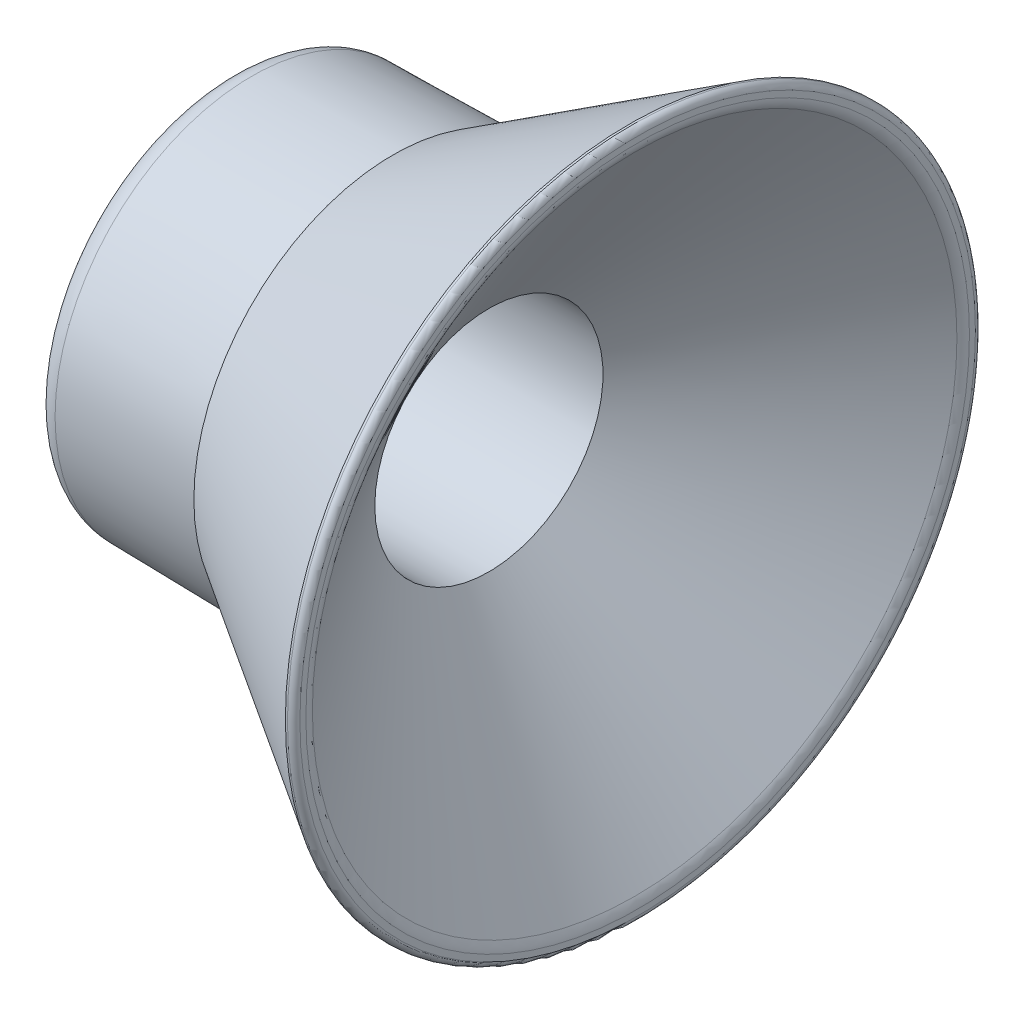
ISO-10303-21;
HEADER;
FILE_DESCRIPTION(('STEP AP214'),'2;1');
FILE_NAME('part.step','',(''),(''),'','','');
FILE_SCHEMA(('AUTOMOTIVE_DESIGN { 1 0 10303 214 1 1 1 1 }'));
ENDSEC;
DATA;
#1=APPLICATION_CONTEXT('core data for automotive mechanical design processes');
#2=APPLICATION_PROTOCOL_DEFINITION('international standard','automotive_design',2000,#1);
#3=PRODUCT_CONTEXT('',#1,'mechanical');
#4=PRODUCT('Part','Part','',(#3));
#5=PRODUCT_RELATED_PRODUCT_CATEGORY('part','',(#4));
#6=PRODUCT_DEFINITION_FORMATION('','',#4);
#7=PRODUCT_DEFINITION_CONTEXT('part definition',#1,'design');
#8=PRODUCT_DEFINITION('design','',#6,#7);
#9=PRODUCT_DEFINITION_SHAPE('','',#8);
#10=(LENGTH_UNIT() NAMED_UNIT(*) SI_UNIT(.MILLI.,.METRE.));
#11=(NAMED_UNIT(*) PLANE_ANGLE_UNIT() SI_UNIT($,.RADIAN.));
#12=(NAMED_UNIT(*) SI_UNIT($,.STERADIAN.) SOLID_ANGLE_UNIT());
#13=UNCERTAINTY_MEASURE_WITH_UNIT(LENGTH_MEASURE(1.E-05),#10,'distance_accuracy_value','');
#14=(GEOMETRIC_REPRESENTATION_CONTEXT(3) GLOBAL_UNCERTAINTY_ASSIGNED_CONTEXT((#13)) GLOBAL_UNIT_ASSIGNED_CONTEXT((#10,
#11,#12)) REPRESENTATION_CONTEXT('',''));
#15=CARTESIAN_POINT('',(0.,0.,0.));
#16=DIRECTION('',(0.,0.,1.));
#17=DIRECTION('',(1.,0.,0.));
#18=AXIS2_PLACEMENT_3D('',#15,#16,#17);
#19=CARTESIAN_POINT('',(0.,0.,0.));
#20=DIRECTION('',(1.,0.,0.));
#21=DIRECTION('',(0.,0.,-1.));
#22=AXIS2_PLACEMENT_3D('',#19,#20,#21);
#23=PLANE('',#22);
#24=CARTESIAN_POINT('',(0.,0.,0.));
#25=DIRECTION('',(-1.,0.,0.));
#26=DIRECTION('',(0.,0.,1.));
#27=AXIS2_PLACEMENT_3D('',#24,#25,#26);
#28=CIRCLE('',#27,5.08);
#29=CARTESIAN_POINT('',(0.,0.,5.08));
#30=VERTEX_POINT('',#29);
#31=EDGE_CURVE('E75',#30,#30,#28,.T.);
#32=ORIENTED_EDGE('',*,*,#31,.F.);
#33=EDGE_LOOP('',(#32));
#34=FACE_BOUND('',#33,.T.);
#35=CARTESIAN_POINT('',(0.,0.,0.));
#36=DIRECTION('',(1.,0.,0.));
#37=DIRECTION('',(0.,0.,-1.));
#38=AXIS2_PLACEMENT_3D('',#35,#36,#37);
#39=CIRCLE('',#38,10.6442741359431);
#40=CARTESIAN_POINT('',(0.,0.,-10.6442741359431));
#41=VERTEX_POINT('',#40);
#42=EDGE_CURVE('E39',#41,#41,#39,.F.);
#43=ORIENTED_EDGE('',*,*,#42,.T.);
#44=EDGE_LOOP('',(#43));
#45=FACE_BOUND('',#44,.T.);
#46=ADVANCED_FACE('F14',(#34,#45),#23,.F.);
#47=CARTESIAN_POINT('',(24.9936,21.0566,0.));
#48=DIRECTION('',(-1.,0.,0.));
#49=DIRECTION('',(0.,0.,1.));
#50=AXIS2_PLACEMENT_3D('',#47,#48,#49);
#51=PLANE('',#50);
#52=CARTESIAN_POINT('',(24.9936,0.,0.));
#53=DIRECTION('',(-1.,0.,0.));
#54=DIRECTION('',(0.,0.,1.));
#55=AXIS2_PLACEMENT_3D('',#52,#53,#54);
#56=CIRCLE('',#55,20.3101435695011);
#57=CARTESIAN_POINT('',(24.9936,0.,20.3101435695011));
#58=VERTEX_POINT('',#57);
#59=EDGE_CURVE('E71',#58,#58,#56,.T.);
#60=ORIENTED_EDGE('',*,*,#59,.T.);
#61=EDGE_LOOP('',(#60));
#62=FACE_BOUND('',#61,.T.);
#63=CARTESIAN_POINT('',(24.9936,0.,0.));
#64=DIRECTION('',(-1.,0.,0.));
#65=DIRECTION('',(0.,0.,1.));
#66=AXIS2_PLACEMENT_3D('',#63,#64,#65);
#67=CIRCLE('',#66,20.6756);
#68=CARTESIAN_POINT('',(24.9936,0.,20.6756));
#69=VERTEX_POINT('',#68);
#70=EDGE_CURVE('E9',#69,#69,#67,.F.);
#71=ORIENTED_EDGE('',*,*,#70,.T.);
#72=EDGE_LOOP('',(#71));
#73=FACE_BOUND('',#72,.T.);
#74=ADVANCED_FACE('F88',(#62,#73),#51,.F.);
#75=CARTESIAN_POINT('',(10.0198875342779,0.,0.));
#76=DIRECTION('',(1.,0.,0.));
#77=DIRECTION('',(0.,0.,-1.));
#78=AXIS2_PLACEMENT_3D('',#75,#76,#77);
#79=CONICAL_SURFACE('',#78,12.192,0.0174532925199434);
#80=CARTESIAN_POINT('',(1.37261898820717,0.,0.));
#81=DIRECTION('',(-1.,0.,0.));
#82=DIRECTION('',(0.,0.,1.));
#83=AXIS2_PLACEMENT_3D('',#80,#81,#82);
#84=CIRCLE('',#83,12.0410613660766);
#85=CARTESIAN_POINT('',(1.37261898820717,0.,12.0410613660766));
#86=VERTEX_POINT('',#85);
#87=EDGE_CURVE('E32',#86,#86,#84,.F.);
#88=ORIENTED_EDGE('',*,*,#87,.T.);
#89=EDGE_LOOP('',(#88));
#90=FACE_BOUND('',#89,.T.);
#91=CARTESIAN_POINT('',(10.0198875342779,0.,0.));
#92=DIRECTION('',(-1.,0.,0.));
#93=DIRECTION('',(0.,0.,1.));
#94=AXIS2_PLACEMENT_3D('',#91,#92,#93);
#95=CIRCLE('',#94,12.192);
#96=CARTESIAN_POINT('',(10.0198875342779,0.,12.192));
#97=VERTEX_POINT('',#96);
#98=EDGE_CURVE('E45',#97,#97,#95,.T.);
#99=ORIENTED_EDGE('',*,*,#98,.T.);
#100=EDGE_LOOP('',(#99));
#101=FACE_BOUND('',#100,.T.);
#102=ADVANCED_FACE('F108',(#90,#101),#79,.T.);
#103=CARTESIAN_POINT('',(24.4856,0.,0.));
#104=DIRECTION('',(1.,0.,0.));
#105=DIRECTION('',(0.,0.,-1.));
#106=AXIS2_PLACEMENT_3D('',#103,#104,#105);
#107=CONICAL_SURFACE('',#106,21.0566,0.549778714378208);
#108=ORIENTED_EDGE('',*,*,#98,.F.);
#109=EDGE_LOOP('',(#108));
#110=FACE_BOUND('',#109,.T.);
#111=CARTESIAN_POINT('',(24.4856,0.,0.));
#112=DIRECTION('',(-1.,0.,0.));
#113=DIRECTION('',(0.,0.,1.));
#114=AXIS2_PLACEMENT_3D('',#111,#112,#113);
#115=CIRCLE('',#114,21.0566);
#116=CARTESIAN_POINT('',(24.4856,0.,21.0566));
#117=VERTEX_POINT('',#116);
#118=EDGE_CURVE('E49',#117,#117,#115,.T.);
#119=ORIENTED_EDGE('',*,*,#118,.T.);
#120=EDGE_LOOP('',(#119));
#121=FACE_BOUND('',#120,.T.);
#122=ADVANCED_FACE('F104',(#110,#121),#107,.T.);
#123=CARTESIAN_POINT('',(0.,0.,0.));
#124=DIRECTION('',(-1.,0.,0.));
#125=DIRECTION('',(0.,0.,1.));
#126=AXIS2_PLACEMENT_3D('',#123,#124,#125);
#127=CYLINDRICAL_SURFACE('',#126,21.0566);
#128=CARTESIAN_POINT('',(24.6126,0.,0.));
#129=DIRECTION('',(-1.,0.,0.));
#130=DIRECTION('',(0.,0.,1.));
#131=AXIS2_PLACEMENT_3D('',#128,#129,#130);
#132=CIRCLE('',#131,21.0566);
#133=CARTESIAN_POINT('',(24.6126,0.,21.0566));
#134=VERTEX_POINT('',#133);
#135=EDGE_CURVE('E22',#134,#134,#132,.T.);
#136=ORIENTED_EDGE('',*,*,#135,.T.);
#137=EDGE_LOOP('',(#136));
#138=FACE_BOUND('',#137,.T.);
#139=ORIENTED_EDGE('',*,*,#118,.F.);
#140=EDGE_LOOP('',(#139));
#141=FACE_BOUND('',#140,.T.);
#142=ADVANCED_FACE('F94',(#138,#141),#127,.T.);
#143=CARTESIAN_POINT('',(1.397,0.,0.));
#144=DIRECTION('',(1.,0.,0.));
#145=DIRECTION('',(0.,0.,-1.));
#146=AXIS2_PLACEMENT_3D('',#143,#144,#145);
#147=TOROIDAL_SURFACE('',#146,10.6442741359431,1.397);
#148=ORIENTED_EDGE('',*,*,#87,.F.);
#149=EDGE_LOOP('',(#148));
#150=FACE_BOUND('',#149,.T.);
#151=ORIENTED_EDGE('',*,*,#42,.F.);
#152=EDGE_LOOP('',(#151));
#153=FACE_BOUND('',#152,.T.);
#154=ADVANCED_FACE('F92',(#150,#153),#147,.T.);
#155=CARTESIAN_POINT('',(24.6126,0.,0.));
#156=DIRECTION('',(-1.,0.,0.));
#157=DIRECTION('',(0.,0.,1.));
#158=AXIS2_PLACEMENT_3D('',#155,#156,#157);
#159=TOROIDAL_SURFACE('',#158,20.6756,0.381);
#160=ORIENTED_EDGE('',*,*,#70,.F.);
#161=EDGE_LOOP('',(#160));
#162=FACE_BOUND('',#161,.T.);
#163=ORIENTED_EDGE('',*,*,#135,.F.);
#164=EDGE_LOOP('',(#163));
#165=FACE_BOUND('',#164,.T.);
#166=ADVANCED_FACE('F16',(#162,#165),#159,.T.);
#167=CARTESIAN_POINT('',(23.9776,0.,0.));
#168=DIRECTION('',(-1.,0.,0.));
#169=DIRECTION('',(0.,0.,1.));
#170=AXIS2_PLACEMENT_3D('',#167,#168,#169);
#171=TOROIDAL_SURFACE('',#170,20.3101435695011,1.016);
#172=CARTESIAN_POINT('',(24.8098584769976,0.,0.));
#173=DIRECTION('',(1.,0.,0.));
#174=DIRECTION('',(0.,0.,-1.));
#175=AXIS2_PLACEMENT_3D('',#172,#173,#174);
#176=CIRCLE('',#175,19.7273899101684);
#177=CARTESIAN_POINT('',(24.8098584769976,0.,-19.7273899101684));
#178=VERTEX_POINT('',#177);
#179=EDGE_CURVE('E52',#178,#178,#176,.T.);
#180=ORIENTED_EDGE('',*,*,#179,.F.);
#181=EDGE_LOOP('',(#180));
#182=FACE_BOUND('',#181,.T.);
#183=ORIENTED_EDGE('',*,*,#59,.F.);
#184=EDGE_LOOP('',(#183));
#185=FACE_BOUND('',#184,.T.);
#186=ADVANCED_FACE('F102',(#182,#185),#171,.T.);
#187=CARTESIAN_POINT('',(24.9936,0.,0.));
#188=DIRECTION('',(1.,0.,0.));
#189=DIRECTION('',(0.,0.,-1.));
#190=AXIS2_PLACEMENT_3D('',#187,#188,#189);
#191=CONICAL_SURFACE('',#190,19.9898,0.959931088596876);
#192=ORIENTED_EDGE('',*,*,#179,.T.);
#193=EDGE_LOOP('',(#192));
#194=FACE_BOUND('',#193,.T.);
#195=CARTESIAN_POINT('',(15.8875410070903,0.,0.));
#196=DIRECTION('',(-1.,0.,0.));
#197=DIRECTION('',(0.,0.,1.));
#198=AXIS2_PLACEMENT_3D('',#195,#196,#197);
#199=CIRCLE('',#198,6.985);
#200=CARTESIAN_POINT('',(15.8875410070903,0.,6.985));
#201=VERTEX_POINT('',#200);
#202=EDGE_CURVE('E55',#201,#201,#199,.T.);
#203=ORIENTED_EDGE('',*,*,#202,.T.);
#204=EDGE_LOOP('',(#203));
#205=FACE_BOUND('',#204,.T.);
#206=ADVANCED_FACE('F120',(#194,#205),#191,.F.);
#207=CARTESIAN_POINT('',(0.,0.,0.));
#208=DIRECTION('',(-1.,0.,0.));
#209=DIRECTION('',(0.,0.,1.));
#210=AXIS2_PLACEMENT_3D('',#207,#208,#209);
#211=CYLINDRICAL_SURFACE('',#210,6.985);
#212=CARTESIAN_POINT('',(5.7912,0.,0.));
#213=DIRECTION('',(-1.,0.,0.));
#214=DIRECTION('',(0.,0.,1.));
#215=AXIS2_PLACEMENT_3D('',#212,#213,#214);
#216=CIRCLE('',#215,6.985);
#217=CARTESIAN_POINT('',(5.7912,0.,6.985));
#218=VERTEX_POINT('',#217);
#219=EDGE_CURVE('E59',#218,#218,#216,.T.);
#220=ORIENTED_EDGE('',*,*,#219,.T.);
#221=EDGE_LOOP('',(#220));
#222=FACE_BOUND('',#221,.T.);
#223=ORIENTED_EDGE('',*,*,#202,.F.);
#224=EDGE_LOOP('',(#223));
#225=FACE_BOUND('',#224,.T.);
#226=ADVANCED_FACE('F124',(#222,#225),#211,.F.);
#227=CARTESIAN_POINT('',(5.7912,3.683,0.));
#228=DIRECTION('',(1.,0.,0.));
#229=DIRECTION('',(0.,0.,-1.));
#230=AXIS2_PLACEMENT_3D('',#227,#228,#229);
#231=PLANE('',#230);
#232=CARTESIAN_POINT('',(5.7912,0.,0.));
#233=DIRECTION('',(-1.,0.,0.));
#234=DIRECTION('',(0.,0.,1.));
#235=AXIS2_PLACEMENT_3D('',#232,#233,#234);
#236=CIRCLE('',#235,3.683);
#237=CARTESIAN_POINT('',(5.7912,0.,3.683));
#238=VERTEX_POINT('',#237);
#239=EDGE_CURVE('E63',#238,#238,#236,.T.);
#240=ORIENTED_EDGE('',*,*,#239,.T.);
#241=EDGE_LOOP('',(#240));
#242=FACE_BOUND('',#241,.T.);
#243=ORIENTED_EDGE('',*,*,#219,.F.);
#244=EDGE_LOOP('',(#243));
#245=FACE_BOUND('',#244,.T.);
#246=ADVANCED_FACE('F128',(#242,#245),#231,.T.);
#247=CARTESIAN_POINT('',(0.,0.,0.));
#248=DIRECTION('',(-1.,0.,0.));
#249=DIRECTION('',(0.,0.,1.));
#250=AXIS2_PLACEMENT_3D('',#247,#248,#249);
#251=CYLINDRICAL_SURFACE('',#250,3.683);
#252=CARTESIAN_POINT('',(1.39699999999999,0.,0.));
#253=DIRECTION('',(-1.,0.,0.));
#254=DIRECTION('',(0.,0.,1.));
#255=AXIS2_PLACEMENT_3D('',#252,#253,#254);
#256=CIRCLE('',#255,3.683);
#257=CARTESIAN_POINT('',(1.39699999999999,0.,3.683));
#258=VERTEX_POINT('',#257);
#259=EDGE_CURVE('E67',#258,#258,#256,.T.);
#260=ORIENTED_EDGE('',*,*,#259,.T.);
#261=EDGE_LOOP('',(#260));
#262=FACE_BOUND('',#261,.T.);
#263=ORIENTED_EDGE('',*,*,#239,.F.);
#264=EDGE_LOOP('',(#263));
#265=FACE_BOUND('',#264,.T.);
#266=ADVANCED_FACE('F132',(#262,#265),#251,.F.);
#267=CARTESIAN_POINT('',(1.39699999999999,0.,0.));
#268=DIRECTION('',(-1.,0.,0.));
#269=DIRECTION('',(0.,0.,1.));
#270=AXIS2_PLACEMENT_3D('',#267,#268,#269);
#271=CONICAL_SURFACE('',#270,3.683,0.785398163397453);
#272=ORIENTED_EDGE('',*,*,#31,.T.);
#273=EDGE_LOOP('',(#272));
#274=FACE_BOUND('',#273,.T.);
#275=ORIENTED_EDGE('',*,*,#259,.F.);
#276=EDGE_LOOP('',(#275));
#277=FACE_BOUND('',#276,.T.);
#278=ADVANCED_FACE('F83',(#274,#277),#271,.F.);
#279=CLOSED_SHELL('',(#46,#74,#102,#122,#142,#154,#166,#186,#206,#226,#246,#266,#278));
#280=MANIFOLD_SOLID_BREP('B1',#279);
#281=ADVANCED_BREP_SHAPE_REPRESENTATION('',(#18,#280),#14);
#282=SHAPE_DEFINITION_REPRESENTATION(#9,#281);
ENDSEC;
END-ISO-10303-21;
